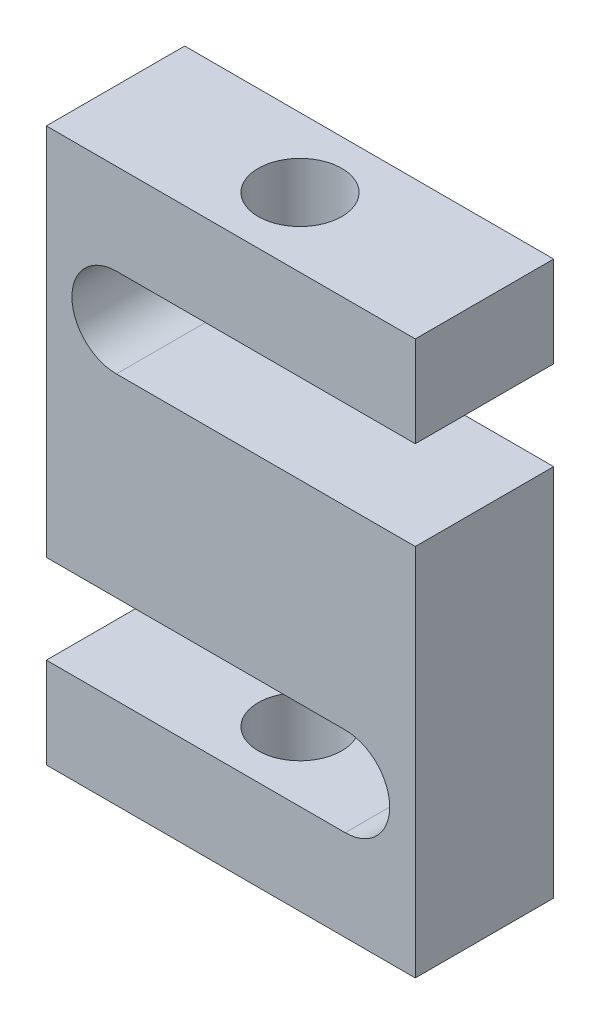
from build123d import *

# Parameters (mm, degrees)
EXTRUDE1_DEPTH               = 9.525
F_1_2_20_TAPPED_HOLE1_REACH  = 82.885
F_1_2_20_TAPPED_HOLE1_BORE_R = 5.75437


with BuildPart() as part:
    # Sketch1 → Extrude1 (new, symmetric)
    with BuildSketch(Plane.XY):
        with BuildLine():
            Line((-25.4, -38.1), (25.4, -38.1))
            Line((25.4, -38.1), (25.4, 13.35))
            Line((25.4, 13.35), (-15.748, 13.35))
            ThreePointArc((-15.748, 13.35), (-21.873, 19.475), (-15.748, 25.6))
            Line((-15.748, 25.6), (25.4, 25.6))
            Line((25.4, 25.6), (25.4, 38.1))
            Line((25.4, 38.1), (-25.4, 38.1))
            Line((-25.4, 38.1), (-25.4, -13.35))
            Line((-25.4, -13.35), (15.748, -13.35))
            ThreePointArc((15.748, -13.35), (21.873, -19.475), (15.748, -25.6))
            Line((15.748, -25.6), (-25.4, -25.6))
            Line((-25.4, -25.6), (-25.4, -38.1))
        make_face()
    extrude(amount=EXTRUDE1_DEPTH, both=True)

    # 1_2-20 Tapped Hole1 bore (on position points) → 1_2-20 Tapped Hole1 (cut, up to next)
    with BuildSketch(Plane(origin=(0, 38.1, 0), x_dir=(1, 0, 0), z_dir=(0, 1, 0)), mode=Mode.PRIVATE) as f_1_2_20_tapped_hole1_sk1:
        Circle(F_1_2_20_TAPPED_HOLE1_BORE_R)
    f_1_2_20_tapped_hole1_tool1 = extrude(f_1_2_20_tapped_hole1_sk1.sketch, amount=-F_1_2_20_TAPPED_HOLE1_REACH, mode=Mode.PRIVATE) & part.part
    f_1_2_20_tapped_hole1 = f_1_2_20_tapped_hole1_tool1.solids().sort_by_distance((0, 38.1, 0))[0]
    add(f_1_2_20_tapped_hole1, mode=Mode.SUBTRACT)

    # Mirror1: 1_2-20 Tapped Hole1 across plane
    add(f_1_2_20_tapped_hole1.mirror(Plane.ZX), mode=Mode.SUBTRACT)


solid = part.part
